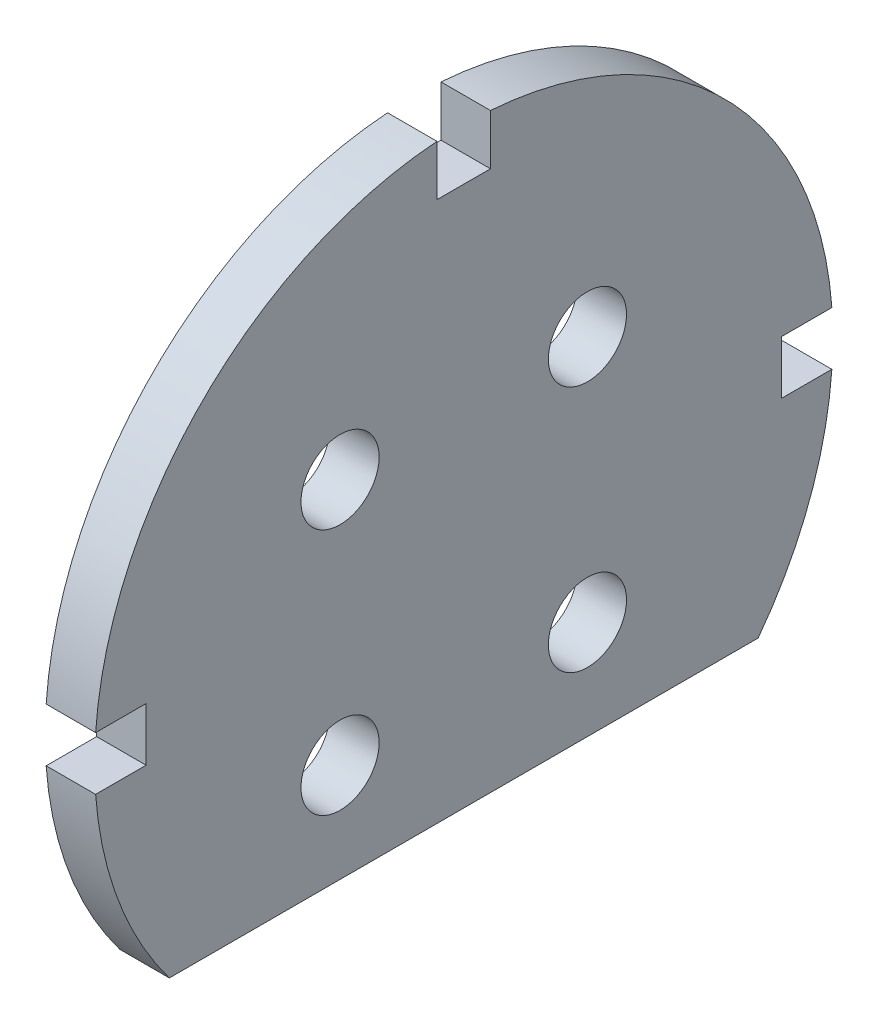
from build123d import *

# Parameters (mm, degrees)
SKETCH1_R           = 47.371
BOSS_EXTRUDE1_DEPTH = 6.35
CUT_EXTRUDE1_DEPTH  = 68.292984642
SKETCH3_R           = 5.0165
CUT_EXTRUDE2_DEPTH  = 68.292984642
SKETCH4_W           = 13.208
SKETCH4_H           = 6.858
CUT_EXTRUDE3_DEPTH  = 68.292984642
SKETCH5_W           = 6.858
SKETCH5_H           = 13.208
CUT_EXTRUDE4_DEPTH  = 68.205563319


with BuildPart() as part:
    # Sketch1 → Boss-Extrude1 (new body)
    with BuildSketch(Plane(origin=(0, 0, 0), x_dir=(0, 0, -1), z_dir=(1, 0, 0))):
        Circle(SKETCH1_R)
    extrude(amount=BOSS_EXTRUDE1_DEPTH)

    # Sketch2 → Cut-Extrude1 (cut, through all)
    with BuildSketch(Plane(origin=(6.35, 0, 0), x_dir=(0, 0, -1), z_dir=(1, 0, 0))):
        with BuildLine():
            Line((-37.782019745, -28.575), (37.782019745, -28.575))
            ThreePointArc((37.782019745, -28.575), (0, -47.371), (-37.782019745, -28.575))
        make_face()
    extrude(amount=-CUT_EXTRUDE1_DEPTH, mode=Mode.SUBTRACT)

    # Sketch3 → Cut-Extrude2 (cut, through all)
    with BuildSketch(Plane(origin=(6.35, 0, 0), x_dir=(0, 0, -1), z_dir=(1, 0, 0))):
        with Locations((-15.875, 15.875)):
            Circle(SKETCH3_R)
        with Locations((15.875, 15.875)):
            Circle(SKETCH3_R)
        with Locations((15.875, -15.875)):
            Circle(SKETCH3_R)
        with Locations((-15.875, -15.875)):
            Circle(SKETCH3_R)
    extrude(amount=-CUT_EXTRUDE2_DEPTH, mode=Mode.SUBTRACT)

    # Sketch4 → Cut-Extrude3 (cut, through all)
    with BuildSketch(Plane(origin=(6.35, 0, 0), x_dir=(0, 0, -1), z_dir=(1, 0, 0))):
        with Locations((-47.371, 0)):
            Rectangle(SKETCH4_W, SKETCH4_H)
        with Locations((47.371, 0)):
            Rectangle(SKETCH4_W, SKETCH4_H)
    extrude(amount=-CUT_EXTRUDE3_DEPTH, mode=Mode.SUBTRACT)

    # Sketch5 → Cut-Extrude4 (cut, through all)
    with BuildSketch(Plane(origin=(6.35, 0, 0), x_dir=(0, 0, -1), z_dir=(1, 0, 0))):
        with Locations((0, 47.371)):
            Rectangle(SKETCH5_W, SKETCH5_H)
    extrude(amount=-CUT_EXTRUDE4_DEPTH, mode=Mode.SUBTRACT)


solid = part.part
